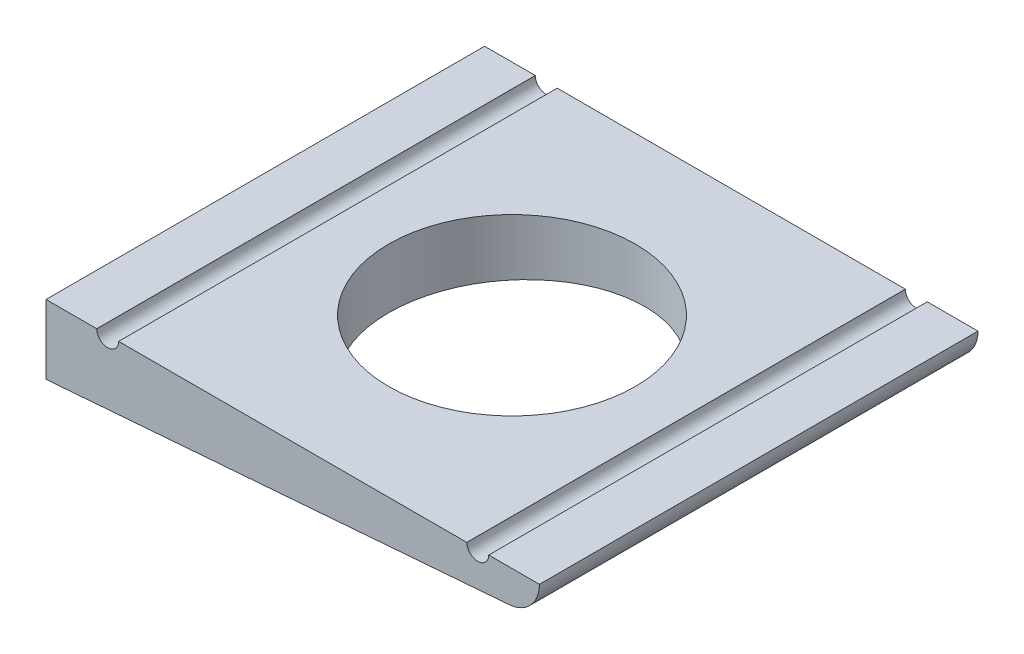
ISO-10303-21;
HEADER;
FILE_DESCRIPTION(('STEP AP214'),'2;1');
FILE_NAME('part.step','',(''),(''),'','','');
FILE_SCHEMA(('AUTOMOTIVE_DESIGN { 1 0 10303 214 1 1 1 1 }'));
ENDSEC;
DATA;
#1=APPLICATION_CONTEXT('core data for automotive mechanical design processes');
#2=APPLICATION_PROTOCOL_DEFINITION('international standard','automotive_design',2000,#1);
#3=PRODUCT_CONTEXT('',#1,'mechanical');
#4=PRODUCT('Part','Part','',(#3));
#5=PRODUCT_RELATED_PRODUCT_CATEGORY('part','',(#4));
#6=PRODUCT_DEFINITION_FORMATION('','',#4);
#7=PRODUCT_DEFINITION_CONTEXT('part definition',#1,'design');
#8=PRODUCT_DEFINITION('design','',#6,#7);
#9=PRODUCT_DEFINITION_SHAPE('','',#8);
#10=(LENGTH_UNIT() NAMED_UNIT(*) SI_UNIT(.MILLI.,.METRE.));
#11=(NAMED_UNIT(*) PLANE_ANGLE_UNIT() SI_UNIT($,.RADIAN.));
#12=(NAMED_UNIT(*) SI_UNIT($,.STERADIAN.) SOLID_ANGLE_UNIT());
#13=UNCERTAINTY_MEASURE_WITH_UNIT(LENGTH_MEASURE(1.E-05),#10,'distance_accuracy_value','');
#14=(GEOMETRIC_REPRESENTATION_CONTEXT(3) GLOBAL_UNCERTAINTY_ASSIGNED_CONTEXT((#13)) GLOBAL_UNIT_ASSIGNED_CONTEXT((#10,
#11,#12)) REPRESENTATION_CONTEXT('',''));
#15=CARTESIAN_POINT('',(0.,0.,0.));
#16=DIRECTION('',(0.,0.,1.));
#17=DIRECTION('',(1.,0.,0.));
#18=AXIS2_PLACEMENT_3D('',#15,#16,#17);
#19=CARTESIAN_POINT('',(15.6,0.,32.));
#20=DIRECTION('',(0.,0.,-1.));
#21=DIRECTION('',(1.,0.,0.));
#22=AXIS2_PLACEMENT_3D('',#19,#20,#21);
#23=CYLINDRICAL_SURFACE('',#22,2.4);
#24=CARTESIAN_POINT('',(15.6,0.,0.));
#25=DIRECTION('',(0.,0.,-1.));
#26=DIRECTION('',(0.,1.,0.));
#27=AXIS2_PLACEMENT_3D('',#24,#25,#26);
#28=CIRCLE('',#27,2.4);
#29=CARTESIAN_POINT('',(18.,0.,0.));
#30=VERTEX_POINT('',#29);
#31=CARTESIAN_POINT('',(15.8477485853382,-2.38717838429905,0.));
#32=VERTEX_POINT('',#31);
#33=EDGE_CURVE('E125',#30,#32,#28,.T.);
#34=ORIENTED_EDGE('',*,*,#33,.F.);
#35=DIRECTION('',(0.,0.,-1.));
#36=VECTOR('',#35,1.);
#37=CARTESIAN_POINT('',(18.,0.,32.));
#38=LINE('',#37,#36);
#39=CARTESIAN_POINT('',(18.,0.,32.));
#40=VERTEX_POINT('',#39);
#41=EDGE_CURVE('E141',#40,#30,#38,.T.);
#42=ORIENTED_EDGE('',*,*,#41,.F.);
#43=CARTESIAN_POINT('',(15.6,0.,32.));
#44=DIRECTION('',(0.,0.,-1.));
#45=DIRECTION('',(0.,1.,0.));
#46=AXIS2_PLACEMENT_3D('',#43,#44,#45);
#47=CIRCLE('',#46,2.4);
#48=CARTESIAN_POINT('',(15.8477485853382,-2.38717838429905,32.));
#49=VERTEX_POINT('',#48);
#50=EDGE_CURVE('E113',#40,#49,#47,.T.);
#51=ORIENTED_EDGE('',*,*,#50,.T.);
#52=DIRECTION('',(0.,0.,-1.));
#53=VECTOR('',#52,1.);
#54=CARTESIAN_POINT('',(15.8477485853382,-2.38717838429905,32.));
#55=LINE('',#54,#53);
#56=EDGE_CURVE('E11',#49,#32,#55,.T.);
#57=ORIENTED_EDGE('',*,*,#56,.T.);
#58=EDGE_LOOP('',(#34,#42,#51,#57));
#59=FACE_BOUND('',#58,.T.);
#60=ADVANCED_FACE('F33',(#59),#23,.T.);
#61=CARTESIAN_POINT('',(-18.,0.,32.));
#62=DIRECTION('',(-1.,0.,0.));
#63=DIRECTION('',(0.,0.,-1.));
#64=AXIS2_PLACEMENT_3D('',#61,#62,#63);
#65=PLANE('',#64);
#66=DIRECTION('',(0.,0.,-1.));
#67=VECTOR('',#66,1.);
#68=CARTESIAN_POINT('',(-18.,-5.05105397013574,132.65798071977));
#69=LINE('',#68,#67);
#70=CARTESIAN_POINT('',(-18.,-5.05105397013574,32.));
#71=VERTEX_POINT('',#70);
#72=CARTESIAN_POINT('',(-18.,-5.05105397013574,0.));
#73=VERTEX_POINT('',#72);
#74=EDGE_CURVE('E102',#71,#73,#69,.T.);
#75=ORIENTED_EDGE('',*,*,#74,.F.);
#76=DIRECTION('',(0.,-1.,0.));
#77=VECTOR('',#76,1.);
#78=CARTESIAN_POINT('',(-18.,0.,32.));
#79=LINE('',#78,#77);
#80=CARTESIAN_POINT('',(-18.,0.,32.));
#81=VERTEX_POINT('',#80);
#82=EDGE_CURVE('E109',#81,#71,#79,.T.);
#83=ORIENTED_EDGE('',*,*,#82,.F.);
#84=DIRECTION('',(0.,0.,-1.));
#85=VECTOR('',#84,1.);
#86=CARTESIAN_POINT('',(-18.,0.,32.));
#87=LINE('',#86,#85);
#88=CARTESIAN_POINT('',(-18.,0.,0.));
#89=VERTEX_POINT('',#88);
#90=EDGE_CURVE('E41',#81,#89,#87,.T.);
#91=ORIENTED_EDGE('',*,*,#90,.T.);
#92=DIRECTION('',(0.,-1.,0.));
#93=VECTOR('',#92,1.);
#94=CARTESIAN_POINT('',(-18.,0.,0.));
#95=LINE('',#94,#93);
#96=EDGE_CURVE('E118',#89,#73,#95,.T.);
#97=ORIENTED_EDGE('',*,*,#96,.T.);
#98=EDGE_LOOP('',(#75,#83,#91,#97));
#99=FACE_BOUND('',#98,.T.);
#100=ADVANCED_FACE('F116',(#99),#65,.T.);
#101=CARTESIAN_POINT('',(-14.3,0.,32.));
#102=DIRECTION('',(0.,1.,0.));
#103=DIRECTION('',(0.,0.,1.));
#104=AXIS2_PLACEMENT_3D('',#101,#102,#103);
#105=PLANE('',#104);
#106=DIRECTION('',(-1.,0.,0.));
#107=VECTOR('',#106,1.);
#108=CARTESIAN_POINT('',(-14.3,0.,0.));
#109=LINE('',#108,#107);
#110=CARTESIAN_POINT('',(-14.3,0.,0.));
#111=VERTEX_POINT('',#110);
#112=EDGE_CURVE('E134',#111,#89,#109,.T.);
#113=ORIENTED_EDGE('',*,*,#112,.T.);
#114=ORIENTED_EDGE('',*,*,#90,.F.);
#115=DIRECTION('',(-1.,0.,0.));
#116=VECTOR('',#115,1.);
#117=CARTESIAN_POINT('',(-14.3,0.,32.));
#118=LINE('',#117,#116);
#119=CARTESIAN_POINT('',(-14.3,0.,32.));
#120=VERTEX_POINT('',#119);
#121=EDGE_CURVE('E49',#120,#81,#118,.T.);
#122=ORIENTED_EDGE('',*,*,#121,.F.);
#123=DIRECTION('',(0.,0.,-1.));
#124=VECTOR('',#123,1.);
#125=CARTESIAN_POINT('',(-14.3,0.,32.));
#126=LINE('',#125,#124);
#127=EDGE_CURVE('E150',#120,#111,#126,.T.);
#128=ORIENTED_EDGE('',*,*,#127,.T.);
#129=EDGE_LOOP('',(#113,#114,#122,#128));
#130=FACE_BOUND('',#129,.T.);
#131=ADVANCED_FACE('F185',(#130),#105,.T.);
#132=CARTESIAN_POINT('',(-13.5,0.,32.));
#133=DIRECTION('',(0.,0.,-1.));
#134=DIRECTION('',(1.,0.,0.));
#135=AXIS2_PLACEMENT_3D('',#132,#133,#134);
#136=CYLINDRICAL_SURFACE('',#135,0.8);
#137=CARTESIAN_POINT('',(-13.5,0.,0.));
#138=DIRECTION('',(0.,0.,-1.));
#139=DIRECTION('',(0.,1.,0.));
#140=AXIS2_PLACEMENT_3D('',#137,#138,#139);
#141=CIRCLE('',#140,0.8);
#142=CARTESIAN_POINT('',(-12.7,0.,0.));
#143=VERTEX_POINT('',#142);
#144=EDGE_CURVE('E132',#143,#111,#141,.T.);
#145=ORIENTED_EDGE('',*,*,#144,.T.);
#146=ORIENTED_EDGE('',*,*,#127,.F.);
#147=CARTESIAN_POINT('',(-13.5,0.,32.));
#148=DIRECTION('',(0.,0.,-1.));
#149=DIRECTION('',(0.,1.,0.));
#150=AXIS2_PLACEMENT_3D('',#147,#148,#149);
#151=CIRCLE('',#150,0.8);
#152=CARTESIAN_POINT('',(-12.7,0.,32.));
#153=VERTEX_POINT('',#152);
#154=EDGE_CURVE('E54',#153,#120,#151,.T.);
#155=ORIENTED_EDGE('',*,*,#154,.F.);
#156=DIRECTION('',(0.,0.,-1.));
#157=VECTOR('',#156,1.);
#158=CARTESIAN_POINT('',(-12.7,0.,32.));
#159=LINE('',#158,#157);
#160=EDGE_CURVE('E153',#153,#143,#159,.T.);
#161=ORIENTED_EDGE('',*,*,#160,.T.);
#162=EDGE_LOOP('',(#145,#146,#155,#161));
#163=FACE_BOUND('',#162,.T.);
#164=ADVANCED_FACE('F182',(#163),#136,.F.);
#165=CARTESIAN_POINT('',(12.7,0.,32.));
#166=DIRECTION('',(0.,1.,0.));
#167=DIRECTION('',(0.,0.,1.));
#168=AXIS2_PLACEMENT_3D('',#165,#166,#167);
#169=PLANE('',#168);
#170=CARTESIAN_POINT('',(0.,0.,16.));
#171=DIRECTION('',(0.,1.,0.));
#172=DIRECTION('',(1.,0.,0.));
#173=AXIS2_PLACEMENT_3D('',#170,#171,#172);
#174=CIRCLE('',#173,9.);
#175=CARTESIAN_POINT('',(9.,0.,16.));
#176=VERTEX_POINT('',#175);
#177=EDGE_CURVE('E105',#176,#176,#174,.T.);
#178=ORIENTED_EDGE('',*,*,#177,.F.);
#179=EDGE_LOOP('',(#178));
#180=FACE_BOUND('',#179,.T.);
#181=DIRECTION('',(-1.,0.,0.));
#182=VECTOR('',#181,1.);
#183=CARTESIAN_POINT('',(12.7,0.,0.));
#184=LINE('',#183,#182);
#185=CARTESIAN_POINT('',(12.7,0.,0.));
#186=VERTEX_POINT('',#185);
#187=EDGE_CURVE('E130',#186,#143,#184,.T.);
#188=ORIENTED_EDGE('',*,*,#187,.T.);
#189=ORIENTED_EDGE('',*,*,#160,.F.);
#190=DIRECTION('',(-1.,0.,0.));
#191=VECTOR('',#190,1.);
#192=CARTESIAN_POINT('',(12.7,0.,32.));
#193=LINE('',#192,#191);
#194=CARTESIAN_POINT('',(12.7,0.,32.));
#195=VERTEX_POINT('',#194);
#196=EDGE_CURVE('E144',#195,#153,#193,.T.);
#197=ORIENTED_EDGE('',*,*,#196,.F.);
#198=DIRECTION('',(0.,0.,-1.));
#199=VECTOR('',#198,1.);
#200=CARTESIAN_POINT('',(12.7,0.,32.));
#201=LINE('',#200,#199);
#202=EDGE_CURVE('E156',#195,#186,#201,.T.);
#203=ORIENTED_EDGE('',*,*,#202,.T.);
#204=EDGE_LOOP('',(#188,#189,#197,#203));
#205=FACE_BOUND('',#204,.T.);
#206=ADVANCED_FACE('F179',(#180,#205),#169,.T.);
#207=CARTESIAN_POINT('',(13.5,0.,32.));
#208=DIRECTION('',(0.,0.,-1.));
#209=DIRECTION('',(1.,0.,0.));
#210=AXIS2_PLACEMENT_3D('',#207,#208,#209);
#211=CYLINDRICAL_SURFACE('',#210,0.8);
#212=CARTESIAN_POINT('',(13.5,0.,0.));
#213=DIRECTION('',(0.,0.,-1.));
#214=DIRECTION('',(0.,1.,0.));
#215=AXIS2_PLACEMENT_3D('',#212,#213,#214);
#216=CIRCLE('',#215,0.8);
#217=CARTESIAN_POINT('',(14.3,0.,0.));
#218=VERTEX_POINT('',#217);
#219=EDGE_CURVE('E128',#218,#186,#216,.T.);
#220=ORIENTED_EDGE('',*,*,#219,.T.);
#221=ORIENTED_EDGE('',*,*,#202,.F.);
#222=CARTESIAN_POINT('',(13.5,0.,32.));
#223=DIRECTION('',(0.,0.,-1.));
#224=DIRECTION('',(0.,1.,0.));
#225=AXIS2_PLACEMENT_3D('',#222,#223,#224);
#226=CIRCLE('',#225,0.8);
#227=CARTESIAN_POINT('',(14.3,0.,32.));
#228=VERTEX_POINT('',#227);
#229=EDGE_CURVE('E142',#228,#195,#226,.T.);
#230=ORIENTED_EDGE('',*,*,#229,.F.);
#231=DIRECTION('',(0.,0.,-1.));
#232=VECTOR('',#231,1.);
#233=CARTESIAN_POINT('',(14.3,0.,32.));
#234=LINE('',#233,#232);
#235=EDGE_CURVE('E159',#228,#218,#234,.T.);
#236=ORIENTED_EDGE('',*,*,#235,.T.);
#237=EDGE_LOOP('',(#220,#221,#230,#236));
#238=FACE_BOUND('',#237,.T.);
#239=ADVANCED_FACE('F175',(#238),#211,.F.);
#240=CARTESIAN_POINT('',(18.,0.,32.));
#241=DIRECTION('',(0.,1.,0.));
#242=DIRECTION('',(1.,0.,0.));
#243=AXIS2_PLACEMENT_3D('',#240,#241,#242);
#244=PLANE('',#243);
#245=DIRECTION('',(-1.,0.,0.));
#246=VECTOR('',#245,1.);
#247=CARTESIAN_POINT('',(18.,0.,0.));
#248=LINE('',#247,#246);
#249=EDGE_CURVE('E126',#30,#218,#248,.T.);
#250=ORIENTED_EDGE('',*,*,#249,.T.);
#251=ORIENTED_EDGE('',*,*,#235,.F.);
#252=DIRECTION('',(-1.,0.,0.));
#253=VECTOR('',#252,1.);
#254=CARTESIAN_POINT('',(18.,0.,32.));
#255=LINE('',#254,#253);
#256=EDGE_CURVE('E139',#40,#228,#255,.T.);
#257=ORIENTED_EDGE('',*,*,#256,.F.);
#258=ORIENTED_EDGE('',*,*,#41,.T.);
#259=EDGE_LOOP('',(#250,#251,#257,#258));
#260=FACE_BOUND('',#259,.T.);
#261=ADVANCED_FACE('F165',(#260),#244,.T.);
#262=CARTESIAN_POINT('',(15.6,0.,32.));
#263=DIRECTION('',(0.,0.,1.));
#264=DIRECTION('',(-1.,0.,0.));
#265=AXIS2_PLACEMENT_3D('',#262,#263,#264);
#266=PLANE('',#265);
#267=DIRECTION('',(0.996917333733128,0.0784590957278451,0.));
#268=VECTOR('',#267,1.);
#269=CARTESIAN_POINT('',(15.7882435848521,-2.39186152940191,32.));
#270=LINE('',#269,#268);
#271=EDGE_CURVE('E99',#71,#49,#270,.T.);
#272=ORIENTED_EDGE('',*,*,#271,.T.);
#273=ORIENTED_EDGE('',*,*,#50,.F.);
#274=ORIENTED_EDGE('',*,*,#256,.T.);
#275=ORIENTED_EDGE('',*,*,#229,.T.);
#276=ORIENTED_EDGE('',*,*,#196,.T.);
#277=ORIENTED_EDGE('',*,*,#154,.T.);
#278=ORIENTED_EDGE('',*,*,#121,.T.);
#279=ORIENTED_EDGE('',*,*,#82,.T.);
#280=EDGE_LOOP('',(#272,#273,#274,#275,#276,#277,#278,#279));
#281=FACE_BOUND('',#280,.T.);
#282=ADVANCED_FACE('F110',(#281),#266,.T.);
#283=CARTESIAN_POINT('',(15.6,0.,0.));
#284=DIRECTION('',(0.,0.,1.));
#285=DIRECTION('',(-1.,0.,0.));
#286=AXIS2_PLACEMENT_3D('',#283,#284,#285);
#287=PLANE('',#286);
#288=ORIENTED_EDGE('',*,*,#96,.F.);
#289=ORIENTED_EDGE('',*,*,#112,.F.);
#290=ORIENTED_EDGE('',*,*,#144,.F.);
#291=ORIENTED_EDGE('',*,*,#187,.F.);
#292=ORIENTED_EDGE('',*,*,#219,.F.);
#293=ORIENTED_EDGE('',*,*,#249,.F.);
#294=ORIENTED_EDGE('',*,*,#33,.T.);
#295=DIRECTION('',(0.996917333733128,0.0784590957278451,0.));
#296=VECTOR('',#295,1.);
#297=CARTESIAN_POINT('',(15.7882435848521,-2.39186152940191,0.));
#298=LINE('',#297,#296);
#299=EDGE_CURVE('E106',#73,#32,#298,.T.);
#300=ORIENTED_EDGE('',*,*,#299,.F.);
#301=EDGE_LOOP('',(#288,#289,#290,#291,#292,#293,#294,#300));
#302=FACE_BOUND('',#301,.T.);
#303=ADVANCED_FACE('F169',(#302),#287,.F.);
#304=CARTESIAN_POINT('',(0.,0.,16.));
#305=DIRECTION('',(0.,-1.,0.));
#306=DIRECTION('',(1.,0.,0.));
#307=AXIS2_PLACEMENT_3D('',#304,#305,#306);
#308=CYLINDRICAL_SURFACE('',#307,9.);
#309=CARTESIAN_POINT('',(0.,-3.6344232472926,16.));
#310=DIRECTION('',(0.0784590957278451,-0.996917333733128,0.));
#311=DIRECTION('',(-0.996917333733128,-0.0784590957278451,0.));
#312=AXIS2_PLACEMENT_3D('',#309,#310,#311);
#313=ELLIPSE('',#312,9.02782978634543,9.);
#314=CARTESIAN_POINT('',(-9.,-4.34273860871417,16.));
#315=VERTEX_POINT('',#314);
#316=EDGE_CURVE('E36',#315,#315,#313,.F.);
#317=ORIENTED_EDGE('',*,*,#316,.F.);
#318=EDGE_LOOP('',(#317));
#319=FACE_BOUND('',#318,.T.);
#320=ORIENTED_EDGE('',*,*,#177,.T.);
#321=EDGE_LOOP('',(#320));
#322=FACE_BOUND('',#321,.T.);
#323=ADVANCED_FACE('F252',(#319,#322),#308,.F.);
#324=CARTESIAN_POINT('',(15.8477485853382,-2.38717838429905,132.65798071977));
#325=DIRECTION('',(-0.0784590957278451,0.996917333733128,0.));
#326=DIRECTION('',(0.996917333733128,0.0784590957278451,0.));
#327=AXIS2_PLACEMENT_3D('',#324,#325,#326);
#328=PLANE('',#327);
#329=ORIENTED_EDGE('',*,*,#316,.T.);
#330=EDGE_LOOP('',(#329));
#331=FACE_BOUND('',#330,.T.);
#332=ORIENTED_EDGE('',*,*,#74,.T.);
#333=ORIENTED_EDGE('',*,*,#299,.T.);
#334=ORIENTED_EDGE('',*,*,#56,.F.);
#335=ORIENTED_EDGE('',*,*,#271,.F.);
#336=EDGE_LOOP('',(#332,#333,#334,#335));
#337=FACE_BOUND('',#336,.T.);
#338=ADVANCED_FACE('F100',(#331,#337),#328,.F.);
#339=CLOSED_SHELL('',(#60,#100,#131,#164,#206,#239,#261,#282,#303,#323,#338));
#340=MANIFOLD_SOLID_BREP('B2',#339);
#341=ADVANCED_BREP_SHAPE_REPRESENTATION('',(#18,#340),#14);
#342=SHAPE_DEFINITION_REPRESENTATION(#9,#341);
ENDSEC;
END-ISO-10303-21;
